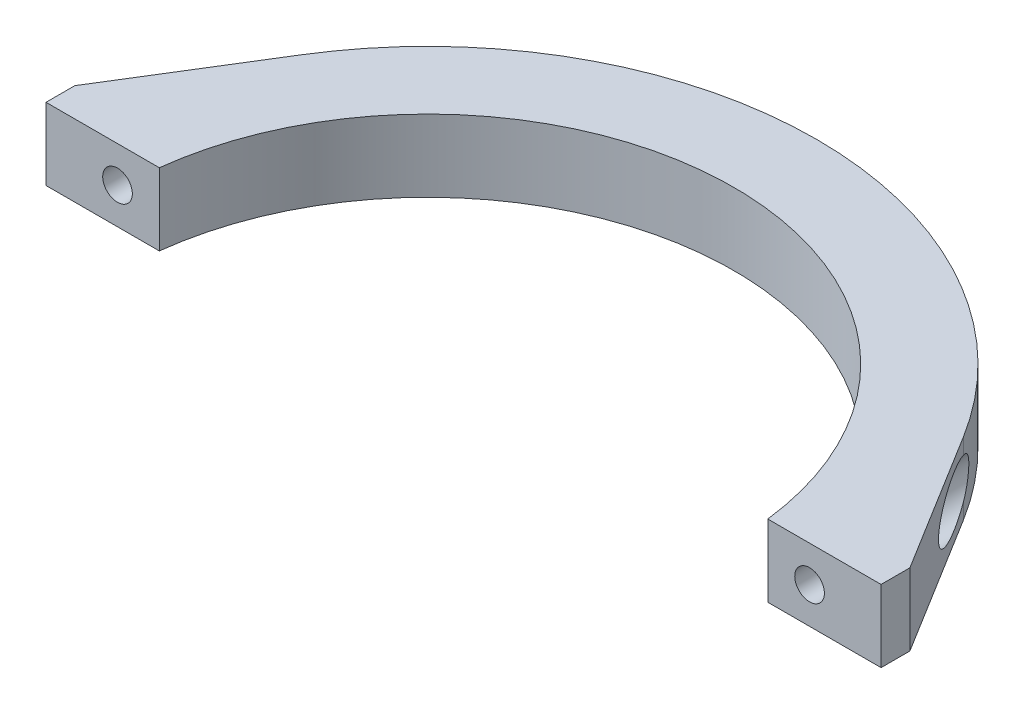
ISO-10303-21;
HEADER;
FILE_DESCRIPTION(('STEP AP214'),'2;1');
FILE_NAME('part.step','',(''),(''),'','','');
FILE_SCHEMA(('AUTOMOTIVE_DESIGN { 1 0 10303 214 1 1 1 1 }'));
ENDSEC;
DATA;
#1=APPLICATION_CONTEXT('core data for automotive mechanical design processes');
#2=APPLICATION_PROTOCOL_DEFINITION('international standard','automotive_design',2000,#1);
#3=PRODUCT_CONTEXT('',#1,'mechanical');
#4=PRODUCT('Part','Part','',(#3));
#5=PRODUCT_RELATED_PRODUCT_CATEGORY('part','',(#4));
#6=PRODUCT_DEFINITION_FORMATION('','',#4);
#7=PRODUCT_DEFINITION_CONTEXT('part definition',#1,'design');
#8=PRODUCT_DEFINITION('design','',#6,#7);
#9=PRODUCT_DEFINITION_SHAPE('','',#8);
#10=(LENGTH_UNIT() NAMED_UNIT(*) SI_UNIT(.MILLI.,.METRE.));
#11=(NAMED_UNIT(*) PLANE_ANGLE_UNIT() SI_UNIT($,.RADIAN.));
#12=(NAMED_UNIT(*) SI_UNIT($,.STERADIAN.) SOLID_ANGLE_UNIT());
#13=UNCERTAINTY_MEASURE_WITH_UNIT(LENGTH_MEASURE(1.E-05),#10,'distance_accuracy_value','');
#14=(GEOMETRIC_REPRESENTATION_CONTEXT(3) GLOBAL_UNCERTAINTY_ASSIGNED_CONTEXT((#13)) GLOBAL_UNIT_ASSIGNED_CONTEXT((#10,
#11,#12)) REPRESENTATION_CONTEXT('',''));
#15=CARTESIAN_POINT('',(0.,0.,0.));
#16=DIRECTION('',(0.,0.,1.));
#17=DIRECTION('',(1.,0.,0.));
#18=AXIS2_PLACEMENT_3D('',#15,#16,#17);
#19=CARTESIAN_POINT('',(91.948,30.9626,-158.75));
#20=DIRECTION('',(1.,0.,0.));
#21=DIRECTION('',(0.,0.,-1.));
#22=AXIS2_PLACEMENT_3D('',#19,#20,#21);
#23=PLANE('',#22);
#24=DIRECTION('',(0.,0.,-1.));
#25=VECTOR('',#24,1.);
#26=CARTESIAN_POINT('',(91.948,46.8376,-158.75));
#27=LINE('',#26,#25);
#28=CARTESIAN_POINT('',(91.948,46.8376,-158.75));
#29=VERTEX_POINT('',#28);
#30=CARTESIAN_POINT('',(91.948,46.8376,-165.1));
#31=VERTEX_POINT('',#30);
#32=EDGE_CURVE('E195',#29,#31,#27,.T.);
#33=ORIENTED_EDGE('',*,*,#32,.F.);
#34=DIRECTION('',(0.,1.,0.));
#35=VECTOR('',#34,1.);
#36=CARTESIAN_POINT('',(91.948,30.9626,-158.75));
#37=LINE('',#36,#35);
#38=CARTESIAN_POINT('',(91.948,30.9626,-158.75));
#39=VERTEX_POINT('',#38);
#40=EDGE_CURVE('E149',#39,#29,#37,.T.);
#41=ORIENTED_EDGE('',*,*,#40,.F.);
#42=DIRECTION('',(0.,0.,-1.));
#43=VECTOR('',#42,1.);
#44=CARTESIAN_POINT('',(91.948,30.9626,-158.75));
#45=LINE('',#44,#43);
#46=CARTESIAN_POINT('',(91.948,30.9626,-165.1));
#47=VERTEX_POINT('',#46);
#48=EDGE_CURVE('E210',#39,#47,#45,.T.);
#49=ORIENTED_EDGE('',*,*,#48,.T.);
#50=DIRECTION('',(0.,1.,0.));
#51=VECTOR('',#50,1.);
#52=CARTESIAN_POINT('',(91.948,30.9626,-165.1));
#53=LINE('',#52,#51);
#54=EDGE_CURVE('E140',#47,#31,#53,.T.);
#55=ORIENTED_EDGE('',*,*,#54,.T.);
#56=EDGE_LOOP('',(#33,#41,#49,#55));
#57=FACE_BOUND('',#56,.T.);
#58=ADVANCED_FACE('F42',(#57),#23,.T.);
#59=CARTESIAN_POINT('',(91.948,30.9626,-158.75));
#60=DIRECTION('',(0.,0.,1.));
#61=DIRECTION('',(1.,0.,0.));
#62=AXIS2_PLACEMENT_3D('',#59,#60,#61);
#63=PLANE('',#62);
#64=CARTESIAN_POINT('',(76.2,38.9001,-158.75));
#65=DIRECTION('',(0.,0.,-1.));
#66=DIRECTION('',(-1.,0.,0.));
#67=AXIS2_PLACEMENT_3D('',#64,#65,#66);
#68=CIRCLE('',#67,3.2639);
#69=CARTESIAN_POINT('',(72.9361,38.9001,-158.75));
#70=VERTEX_POINT('',#69);
#71=EDGE_CURVE('E294',#70,#70,#68,.T.);
#72=ORIENTED_EDGE('',*,*,#71,.T.);
#73=EDGE_LOOP('',(#72));
#74=FACE_BOUND('',#73,.T.);
#75=DIRECTION('',(1.,0.,0.));
#76=VECTOR('',#75,1.);
#77=CARTESIAN_POINT('',(91.948,46.8376,-158.75));
#78=LINE('',#77,#76);
#79=CARTESIAN_POINT('',(66.9938169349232,46.8376,-158.75));
#80=VERTEX_POINT('',#79);
#81=EDGE_CURVE('E205',#80,#29,#78,.T.);
#82=ORIENTED_EDGE('',*,*,#81,.F.);
#83=DIRECTION('',(0.,1.,0.));
#84=VECTOR('',#83,1.);
#85=CARTESIAN_POINT('',(66.9938169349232,30.9626,-158.75));
#86=LINE('',#85,#84);
#87=CARTESIAN_POINT('',(66.9938169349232,30.9626,-158.75));
#88=VERTEX_POINT('',#87);
#89=EDGE_CURVE('E219',#88,#80,#86,.T.);
#90=ORIENTED_EDGE('',*,*,#89,.F.);
#91=DIRECTION('',(1.,0.,0.));
#92=VECTOR('',#91,1.);
#93=CARTESIAN_POINT('',(91.948,30.9626,-158.75));
#94=LINE('',#93,#92);
#95=EDGE_CURVE('E143',#88,#39,#94,.T.);
#96=ORIENTED_EDGE('',*,*,#95,.T.);
#97=ORIENTED_EDGE('',*,*,#40,.T.);
#98=EDGE_LOOP('',(#82,#90,#96,#97));
#99=FACE_BOUND('',#98,.T.);
#100=ADVANCED_FACE('F167',(#74,#99),#63,.T.);
#101=CARTESIAN_POINT('',(0.,30.9626,-150.8125));
#102=DIRECTION('',(0.,1.,0.));
#103=DIRECTION('',(0.,0.,1.));
#104=AXIS2_PLACEMENT_3D('',#101,#102,#103);
#105=CYLINDRICAL_SURFACE('',#104,67.4624);
#106=CARTESIAN_POINT('',(0.,46.8376,-150.8125));
#107=DIRECTION('',(0.,-1.,0.));
#108=DIRECTION('',(0.,0.,1.));
#109=AXIS2_PLACEMENT_3D('',#106,#107,#108);
#110=CIRCLE('',#109,67.4624);
#111=CARTESIAN_POINT('',(-66.9938169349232,46.8376,-158.75));
#112=VERTEX_POINT('',#111);
#113=EDGE_CURVE('E208',#112,#80,#110,.T.);
#114=ORIENTED_EDGE('',*,*,#113,.F.);
#115=DIRECTION('',(0.,1.,0.));
#116=VECTOR('',#115,1.);
#117=CARTESIAN_POINT('',(-66.9938169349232,30.9626,-158.75));
#118=LINE('',#117,#116);
#119=CARTESIAN_POINT('',(-66.9938169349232,30.9626,-158.75));
#120=VERTEX_POINT('',#119);
#121=EDGE_CURVE('E221',#120,#112,#118,.T.);
#122=ORIENTED_EDGE('',*,*,#121,.F.);
#123=CARTESIAN_POINT('',(0.,30.9626,-150.8125));
#124=DIRECTION('',(0.,-1.,0.));
#125=DIRECTION('',(0.,0.,1.));
#126=AXIS2_PLACEMENT_3D('',#123,#124,#125);
#127=CIRCLE('',#126,67.4624);
#128=EDGE_CURVE('E246',#120,#88,#127,.T.);
#129=ORIENTED_EDGE('',*,*,#128,.T.);
#130=ORIENTED_EDGE('',*,*,#89,.T.);
#131=EDGE_LOOP('',(#114,#122,#129,#130));
#132=FACE_BOUND('',#131,.T.);
#133=ADVANCED_FACE('F170',(#132),#105,.F.);
#134=CARTESIAN_POINT('',(-91.948,30.9626,-158.75));
#135=DIRECTION('',(0.,0.,1.));
#136=DIRECTION('',(1.,0.,0.));
#137=AXIS2_PLACEMENT_3D('',#134,#135,#136);
#138=PLANE('',#137);
#139=CARTESIAN_POINT('',(-76.2,38.9001,-158.75));
#140=DIRECTION('',(0.,0.,-1.));
#141=DIRECTION('',(-1.,0.,0.));
#142=AXIS2_PLACEMENT_3D('',#139,#140,#141);
#143=CIRCLE('',#142,3.2639);
#144=CARTESIAN_POINT('',(-79.4639,38.9001,-158.75));
#145=VERTEX_POINT('',#144);
#146=EDGE_CURVE('E303',#145,#145,#143,.T.);
#147=ORIENTED_EDGE('',*,*,#146,.T.);
#148=EDGE_LOOP('',(#147));
#149=FACE_BOUND('',#148,.T.);
#150=DIRECTION('',(1.,0.,0.));
#151=VECTOR('',#150,1.);
#152=CARTESIAN_POINT('',(-91.948,46.8376,-158.75));
#153=LINE('',#152,#151);
#154=CARTESIAN_POINT('',(-91.948,46.8376,-158.75));
#155=VERTEX_POINT('',#154);
#156=EDGE_CURVE('E214',#155,#112,#153,.T.);
#157=ORIENTED_EDGE('',*,*,#156,.F.);
#158=DIRECTION('',(0.,1.,0.));
#159=VECTOR('',#158,1.);
#160=CARTESIAN_POINT('',(-91.948,30.9626,-158.75));
#161=LINE('',#160,#159);
#162=CARTESIAN_POINT('',(-91.948,30.9626,-158.75));
#163=VERTEX_POINT('',#162);
#164=EDGE_CURVE('E223',#163,#155,#161,.T.);
#165=ORIENTED_EDGE('',*,*,#164,.F.);
#166=DIRECTION('',(1.,0.,0.));
#167=VECTOR('',#166,1.);
#168=CARTESIAN_POINT('',(-91.948,30.9626,-158.75));
#169=LINE('',#168,#167);
#170=EDGE_CURVE('E238',#163,#120,#169,.T.);
#171=ORIENTED_EDGE('',*,*,#170,.T.);
#172=ORIENTED_EDGE('',*,*,#121,.T.);
#173=EDGE_LOOP('',(#157,#165,#171,#172));
#174=FACE_BOUND('',#173,.T.);
#175=ADVANCED_FACE('F174',(#149,#174),#138,.T.);
#176=CARTESIAN_POINT('',(-91.948,30.9626,-158.75));
#177=DIRECTION('',(-1.,0.,0.));
#178=DIRECTION('',(0.,0.,1.));
#179=AXIS2_PLACEMENT_3D('',#176,#177,#178);
#180=PLANE('',#179);
#181=DIRECTION('',(0.,0.,1.));
#182=VECTOR('',#181,1.);
#183=CARTESIAN_POINT('',(-91.948,46.8376,-158.75));
#184=LINE('',#183,#182);
#185=CARTESIAN_POINT('',(-91.948,46.8376,-165.1));
#186=VERTEX_POINT('',#185);
#187=EDGE_CURVE('E261',#186,#155,#184,.T.);
#188=ORIENTED_EDGE('',*,*,#187,.F.);
#189=DIRECTION('',(0.,1.,0.));
#190=VECTOR('',#189,1.);
#191=CARTESIAN_POINT('',(-91.948,30.9626,-165.1));
#192=LINE('',#191,#190);
#193=CARTESIAN_POINT('',(-91.948,30.9626,-165.1));
#194=VERTEX_POINT('',#193);
#195=EDGE_CURVE('E224',#194,#186,#192,.T.);
#196=ORIENTED_EDGE('',*,*,#195,.F.);
#197=DIRECTION('',(0.,0.,1.));
#198=VECTOR('',#197,1.);
#199=CARTESIAN_POINT('',(-91.948,30.9626,-158.75));
#200=LINE('',#199,#198);
#201=EDGE_CURVE('E236',#194,#163,#200,.T.);
#202=ORIENTED_EDGE('',*,*,#201,.T.);
#203=ORIENTED_EDGE('',*,*,#164,.T.);
#204=EDGE_LOOP('',(#188,#196,#202,#203));
#205=FACE_BOUND('',#204,.T.);
#206=ADVANCED_FACE('F178',(#205),#180,.T.);
#207=CARTESIAN_POINT('',(-91.948,30.9626,-165.1));
#208=DIRECTION('',(-0.850621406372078,0.,-0.525778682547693));
#209=DIRECTION('',(-0.525778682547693,0.,0.850621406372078));
#210=AXIS2_PLACEMENT_3D('',#207,#208,#209);
#211=PLANE('',#210);
#212=CARTESIAN_POINT('',(-76.2,38.9001,-190.577613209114));
#213=DIRECTION('',(-0.850621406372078,0.,-0.525778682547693));
#214=DIRECTION('',(-0.525778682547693,0.,0.850621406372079));
#215=AXIS2_PLACEMENT_3D('',#212,#213,#214);
#216=ELLIPSE('',#215,10.5676593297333,5.55625);
#217=CARTESIAN_POINT('',(-72.9195200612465,34.415641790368,-195.884877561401));
#218=VERTEX_POINT('',#217);
#219=CARTESIAN_POINT('',(-72.9195200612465,43.384558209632,-195.884877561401));
#220=VERTEX_POINT('',#219);
#221=EDGE_CURVE('E63',#218,#220,#216,.T.);
#222=ORIENTED_EDGE('',*,*,#221,.F.);
#223=DIRECTION('',(0.,1.,0.));
#224=VECTOR('',#223,1.);
#225=CARTESIAN_POINT('',(-72.9195200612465,30.9626,-195.884877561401));
#226=LINE('',#225,#224);
#227=CARTESIAN_POINT('',(-72.9195200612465,30.9626,-195.884877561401));
#228=VERTEX_POINT('',#227);
#229=EDGE_CURVE('E138',#228,#218,#226,.T.);
#230=ORIENTED_EDGE('',*,*,#229,.F.);
#231=DIRECTION('',(-0.525778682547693,0.,0.850621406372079));
#232=VECTOR('',#231,1.);
#233=CARTESIAN_POINT('',(-91.948,30.9626,-165.1));
#234=LINE('',#233,#232);
#235=EDGE_CURVE('E232',#228,#194,#234,.T.);
#236=ORIENTED_EDGE('',*,*,#235,.T.);
#237=ORIENTED_EDGE('',*,*,#195,.T.);
#238=DIRECTION('',(-0.525778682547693,0.,0.850621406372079));
#239=VECTOR('',#238,1.);
#240=CARTESIAN_POINT('',(-91.948,46.8376,-165.1));
#241=LINE('',#240,#239);
#242=CARTESIAN_POINT('',(-72.9195200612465,46.8376,-195.884877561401));
#243=VERTEX_POINT('',#242);
#244=EDGE_CURVE('E257',#243,#186,#241,.T.);
#245=ORIENTED_EDGE('',*,*,#244,.F.);
#246=EDGE_CURVE('E135',#220,#243,#226,.T.);
#247=ORIENTED_EDGE('',*,*,#246,.F.);
#248=EDGE_LOOP('',(#222,#230,#236,#237,#245,#247));
#249=FACE_BOUND('',#248,.T.);
#250=ADVANCED_FACE('F181',(#249),#211,.T.);
#251=CARTESIAN_POINT('',(0.,30.9626,-150.8125));
#252=DIRECTION('',(0.,1.,0.));
#253=DIRECTION('',(0.,0.,1.));
#254=AXIS2_PLACEMENT_3D('',#251,#252,#253);
#255=CYLINDRICAL_SURFACE('',#254,85.725);
#256=CARTESIAN_POINT('',(81.75625,38.9001,-176.594106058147));
#257=CARTESIAN_POINT('',(81.7562426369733,38.7890060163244,-176.594130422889));
#258=CARTESIAN_POINT('',(81.7528677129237,38.6777804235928,-176.604839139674));
#259=CARTESIAN_POINT('',(81.7398358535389,38.4594080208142,-176.646107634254));
#260=CARTESIAN_POINT('',(81.7301632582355,38.3522720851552,-176.676716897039));
#261=CARTESIAN_POINT('',(81.7024748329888,38.1177792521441,-176.764066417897));
#262=CARTESIAN_POINT('',(81.6829443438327,37.9923996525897,-176.825529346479));
#263=CARTESIAN_POINT('',(81.6379906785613,37.7533332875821,-176.966267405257));
#264=CARTESIAN_POINT('',(81.6125544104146,37.6396733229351,-177.045582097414));
#265=CARTESIAN_POINT('',(81.5598762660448,37.4324338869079,-177.208881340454));
#266=CARTESIAN_POINT('',(81.5329783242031,37.3379680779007,-177.291876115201));
#267=CARTESIAN_POINT('',(81.4765122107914,37.1567263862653,-177.465115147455));
#268=CARTESIAN_POINT('',(81.446941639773,37.0699575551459,-177.555365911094));
#269=CARTESIAN_POINT('',(81.3856494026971,36.9028803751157,-177.741319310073));
#270=CARTESIAN_POINT('',(81.3539228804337,36.822587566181,-177.837034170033));
#271=CARTESIAN_POINT('',(81.2887756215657,36.6677651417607,-178.032367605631));
#272=CARTESIAN_POINT('',(81.2553555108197,36.5932334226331,-178.131984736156));
#273=CARTESIAN_POINT('',(81.1688142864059,36.4105599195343,-178.388322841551));
#274=CARTESIAN_POINT('',(81.1147155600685,36.305760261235,-178.547091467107));
#275=CARTESIAN_POINT('',(81.0037339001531,36.1056183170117,-178.869582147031));
#276=CARTESIAN_POINT('',(80.9468495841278,36.0102807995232,-179.033306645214));
#277=CARTESIAN_POINT('',(80.8305979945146,35.8274420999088,-179.364573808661));
#278=CARTESIAN_POINT('',(80.7712268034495,35.7399540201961,-179.532122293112));
#279=CARTESIAN_POINT('',(80.6503305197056,35.5718594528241,-179.869891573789));
#280=CARTESIAN_POINT('',(80.5888050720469,35.4912541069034,-180.04011280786));
#281=CARTESIAN_POINT('',(80.4634433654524,35.3356931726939,-180.383490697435));
#282=CARTESIAN_POINT('',(80.3995964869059,35.2607701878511,-180.55665819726));
#283=CARTESIAN_POINT('',(80.2700240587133,35.1164228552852,-180.90458110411));
#284=CARTESIAN_POINT('',(80.2042983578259,35.0469989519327,-181.079336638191));
#285=CARTESIAN_POINT('',(80.0045763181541,34.8463629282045,-181.605092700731));
#286=CARTESIAN_POINT('',(79.8679026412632,34.722624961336,-181.957945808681));
#287=CARTESIAN_POINT('',(79.5873387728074,34.4920508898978,-182.668073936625));
#288=CARTESIAN_POINT('',(79.4434209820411,34.3852870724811,-183.025361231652));
#289=CARTESIAN_POINT('',(79.1491527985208,34.1877960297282,-183.74177598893));
#290=CARTESIAN_POINT('',(78.9988013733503,34.0970713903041,-184.10090373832));
#291=CARTESIAN_POINT('',(78.6917304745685,33.9308244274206,-184.820445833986));
#292=CARTESIAN_POINT('',(78.5350039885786,33.8553194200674,-185.180861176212));
#293=CARTESIAN_POINT('',(78.2155315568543,33.7193978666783,-185.901838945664));
#294=CARTESIAN_POINT('',(78.0527860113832,33.6589803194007,-186.262401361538));
#295=CARTESIAN_POINT('',(77.7223052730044,33.5536601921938,-186.981195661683));
#296=CARTESIAN_POINT('',(77.5546004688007,33.5086784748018,-187.339429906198));
#297=CARTESIAN_POINT('',(77.2135836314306,33.4342953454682,-188.054884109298));
#298=CARTESIAN_POINT('',(77.0402712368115,33.4048949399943,-188.41210400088));
#299=CARTESIAN_POINT('',(76.6884779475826,33.3625319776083,-189.124516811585));
#300=CARTESIAN_POINT('',(76.510002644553,33.3495522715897,-189.479711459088));
#301=CARTESIAN_POINT('',(76.1480594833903,33.3411445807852,-190.187703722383));
#302=CARTESIAN_POINT('',(75.9645925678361,33.3457133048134,-190.54050177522));
#303=CARTESIAN_POINT('',(75.6231725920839,33.3716691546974,-191.186034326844));
#304=CARTESIAN_POINT('',(75.4658996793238,33.3902126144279,-191.479242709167));
#305=CARTESIAN_POINT('',(75.1484962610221,33.4418847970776,-192.06282654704));
#306=CARTESIAN_POINT('',(74.9883658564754,33.4750130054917,-192.353202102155));
#307=CARTESIAN_POINT('',(74.6652742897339,33.5574033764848,-192.93116970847));
#308=CARTESIAN_POINT('',(74.5023065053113,33.6067100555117,-193.218751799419));
#309=CARTESIAN_POINT('',(74.1746535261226,33.7232163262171,-193.789291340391));
#310=CARTESIAN_POINT('',(74.0099684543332,33.7904146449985,-194.072249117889));
#311=CARTESIAN_POINT('',(73.6776585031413,33.9459291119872,-194.635856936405));
#312=CARTESIAN_POINT('',(73.5100232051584,34.0345079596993,-194.916429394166));
#313=CARTESIAN_POINT('',(73.1752683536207,34.2352270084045,-195.469641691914));
#314=CARTESIAN_POINT('',(73.0081491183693,34.3473795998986,-195.742277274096));
#315=CARTESIAN_POINT('',(72.6774511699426,34.5981892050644,-196.275246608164));
#316=CARTESIAN_POINT('',(72.5138581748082,34.7366992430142,-196.535639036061));
#317=CARTESIAN_POINT('',(72.273047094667,34.9677641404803,-196.914612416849));
#318=CARTESIAN_POINT('',(72.1935812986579,35.0486193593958,-197.038937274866));
#319=CARTESIAN_POINT('',(72.0367090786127,35.2187524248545,-197.283019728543));
#320=CARTESIAN_POINT('',(71.9593023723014,35.3080291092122,-197.402777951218));
#321=CARTESIAN_POINT('',(71.7669814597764,35.5453442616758,-197.698760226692));
#322=CARTESIAN_POINT('',(71.6538730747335,35.6994959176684,-197.871364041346));
#323=CARTESIAN_POINT('',(71.4373315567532,36.0316032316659,-198.199438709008));
#324=CARTESIAN_POINT('',(71.3339063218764,36.2095780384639,-198.354895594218));
#325=CARTESIAN_POINT('',(71.1404730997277,36.5936514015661,-198.643862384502));
#326=CARTESIAN_POINT('',(71.0506350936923,36.8000528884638,-198.777096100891));
#327=CARTESIAN_POINT('',(70.9324056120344,37.1286876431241,-198.951615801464));
#328=CARTESIAN_POINT('',(70.8957676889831,37.2413301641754,-199.005542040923));
#329=CARTESIAN_POINT('',(70.8289218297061,37.4725447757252,-199.103730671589));
#330=CARTESIAN_POINT('',(70.7987107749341,37.5911139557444,-199.147997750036));
#331=CARTESIAN_POINT('',(70.7347525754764,37.8834467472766,-199.241570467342));
#332=CARTESIAN_POINT('',(70.7046729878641,38.0598314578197,-199.285443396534));
#333=CARTESIAN_POINT('',(70.6616711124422,38.4189701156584,-199.348109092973));
#334=CARTESIAN_POINT('',(70.648735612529,38.60171904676,-199.366921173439));
#335=CARTESIAN_POINT('',(70.641138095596,38.9688070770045,-199.377974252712));
#336=CARTESIAN_POINT('',(70.6465137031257,39.1531486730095,-199.370160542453));
#337=CARTESIAN_POINT('',(70.6751256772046,39.5174433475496,-199.328506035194));
#338=CARTESIAN_POINT('',(70.6983696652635,39.6973945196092,-199.294654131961));
#339=CARTESIAN_POINT('',(70.7602140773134,40.0452457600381,-199.204344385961));
#340=CARTESIAN_POINT('',(70.7985449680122,40.2132993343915,-199.148283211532));
#341=CARTESIAN_POINT('',(70.8879777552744,40.5380124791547,-199.017028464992));
#342=CARTESIAN_POINT('',(70.9390844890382,40.6946677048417,-198.941827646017));
#343=CARTESIAN_POINT('',(71.0847077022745,41.0843456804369,-198.726642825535));
#344=CARTESIAN_POINT('',(71.1870396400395,41.3078548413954,-198.574622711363));
#345=CARTESIAN_POINT('',(71.3531308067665,41.619239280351,-198.325829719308));
#346=CARTESIAN_POINT('',(71.4107083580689,41.7192123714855,-198.239263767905));
#347=CARTESIAN_POINT('',(71.5292818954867,41.9115855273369,-198.060240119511));
#348=CARTESIAN_POINT('',(71.5902772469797,42.0039869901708,-197.967783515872));
#349=CARTESIAN_POINT('',(71.7536371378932,42.2366737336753,-197.719055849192));
#350=CARTESIAN_POINT('',(71.8581991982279,42.3711185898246,-197.558767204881));
#351=CARTESIAN_POINT('',(72.0721151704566,42.622973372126,-197.228280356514));
#352=CARTESIAN_POINT('',(72.1814721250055,42.7403722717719,-197.058075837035));
#353=CARTESIAN_POINT('',(72.4034050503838,42.9599233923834,-196.709833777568));
#354=CARTESIAN_POINT('',(72.5159844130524,43.06205878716,-196.531787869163));
#355=CARTESIAN_POINT('',(72.7430785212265,43.25252164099,-196.169592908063));
#356=CARTESIAN_POINT('',(72.8575939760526,43.3408439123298,-195.985441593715));
#357=CARTESIAN_POINT('',(73.0770412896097,43.4974358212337,-195.629475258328));
#358=CARTESIAN_POINT('',(73.1818850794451,43.5668029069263,-195.4580848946));
#359=CARTESIAN_POINT('',(73.3919143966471,43.6961157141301,-195.111975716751));
#360=CARTESIAN_POINT('',(73.4970999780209,43.7560598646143,-194.937256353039));
#361=CARTESIAN_POINT('',(73.8126699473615,43.9229809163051,-194.40875638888));
#362=CARTESIAN_POINT('',(74.0229737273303,44.016981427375,-194.050785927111));
#363=CARTESIAN_POINT('',(74.4415063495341,44.1754916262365,-193.326185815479));
#364=CARTESIAN_POINT('',(74.6497288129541,44.2399281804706,-192.959537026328));
#365=CARTESIAN_POINT('',(75.0622803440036,44.3427743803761,-192.220336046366));
#366=CARTESIAN_POINT('',(75.2666081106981,44.3811754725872,-191.847781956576));
#367=CARTESIAN_POINT('',(75.6452771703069,44.4314637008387,-191.144952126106));
#368=CARTESIAN_POINT('',(75.820192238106,44.4460504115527,-190.815169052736));
#369=CARTESIAN_POINT('',(76.1658265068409,44.4589357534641,-190.153089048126));
#370=CARTESIAN_POINT('',(76.3365455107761,44.4572336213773,-189.820791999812));
#371=CARTESIAN_POINT('',(76.6735855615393,44.4387041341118,-189.154077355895));
#372=CARTESIAN_POINT('',(76.8399029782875,44.4218646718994,-188.819658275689));
#373=CARTESIAN_POINT('',(77.1677605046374,44.3739287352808,-188.149499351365));
#374=CARTESIAN_POINT('',(77.3293004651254,44.3428318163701,-187.813759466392));
#375=CARTESIAN_POINT('',(77.6471167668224,44.2670735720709,-187.142083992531));
#376=CARTESIAN_POINT('',(77.8034021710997,44.222437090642,-186.806149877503));
#377=CARTESIAN_POINT('',(78.1108652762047,44.1199439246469,-186.133951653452));
#378=CARTESIAN_POINT('',(78.2620428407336,44.0620868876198,-185.797687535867));
#379=CARTESIAN_POINT('',(78.5590336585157,43.9332952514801,-185.12559863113));
#380=CARTESIAN_POINT('',(78.7048507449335,43.8623702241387,-184.78977370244));
#381=CARTESIAN_POINT('',(78.9910768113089,43.7072109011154,-184.11893110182));
#382=CARTESIAN_POINT('',(79.1314864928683,43.6229783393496,-183.783913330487));
#383=CARTESIAN_POINT('',(79.3553122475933,43.4746599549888,-183.240286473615));
#384=CARTESIAN_POINT('',(79.4404228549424,43.4148045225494,-183.031212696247));
#385=CARTESIAN_POINT('',(79.6084008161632,43.28937211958,-182.613894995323));
#386=CARTESIAN_POINT('',(79.6912683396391,43.223795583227,-182.405651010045));
#387=CARTESIAN_POINT('',(79.8547286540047,43.0865385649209,-181.990180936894));
#388=CARTESIAN_POINT('',(79.9353205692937,43.0148557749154,-181.782955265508));
#389=CARTESIAN_POINT('',(80.0941070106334,42.8649166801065,-181.369963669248));
#390=CARTESIAN_POINT('',(80.1723015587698,42.7866604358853,-181.16419773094));
#391=CARTESIAN_POINT('',(80.3276208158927,42.6213591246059,-180.750746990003));
#392=CARTESIAN_POINT('',(80.4046976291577,42.5341762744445,-180.5430990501));
#393=CARTESIAN_POINT('',(80.5560438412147,42.3513156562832,-180.130543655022));
#394=CARTESIAN_POINT('',(80.6303135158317,42.2556387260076,-179.925635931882));
#395=CARTESIAN_POINT('',(80.7756367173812,42.0545932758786,-179.51996359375));
#396=CARTESIAN_POINT('',(80.8466960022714,41.9492432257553,-179.319191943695));
#397=CARTESIAN_POINT('',(80.9852822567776,41.7267922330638,-178.923060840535));
#398=CARTESIAN_POINT('',(81.0528109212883,41.6096970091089,-178.727698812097));
#399=CARTESIAN_POINT('',(81.1735853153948,41.3799213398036,-178.374321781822));
#400=CARTESIAN_POINT('',(81.2274337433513,41.2693154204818,-178.21517228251));
#401=CARTESIAN_POINT('',(81.3314439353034,41.0347563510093,-177.904908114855));
#402=CARTESIAN_POINT('',(81.3815970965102,40.910773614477,-177.75381240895));
#403=CARTESIAN_POINT('',(81.4531517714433,40.7115432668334,-177.536377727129));
#404=CARTESIAN_POINT('',(81.4765155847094,40.6424832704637,-177.465047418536));
#405=CARTESIAN_POINT('',(81.5215912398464,40.4995407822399,-177.326856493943));
#406=CARTESIAN_POINT('',(81.5433024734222,40.4256565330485,-177.25999752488));
#407=CARTESIAN_POINT('',(81.6052596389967,40.1962988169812,-177.068449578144));
#408=CARTESIAN_POINT('',(81.6425856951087,40.0324396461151,-176.952007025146));
#409=CARTESIAN_POINT('',(81.6897821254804,39.7622469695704,-176.804002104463));
#410=CARTESIAN_POINT('',(81.7043484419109,39.6645960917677,-176.758148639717));
#411=CARTESIAN_POINT('',(81.7285908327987,39.4629725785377,-176.681683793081));
#412=CARTESIAN_POINT('',(81.7382803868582,39.3590182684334,-176.651030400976));
#413=CARTESIAN_POINT('',(81.7487201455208,39.195077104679,-176.617974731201));
#414=CARTESIAN_POINT('',(81.7515314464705,39.1364914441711,-176.60906518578));
#415=CARTESIAN_POINT('',(81.7552985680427,39.0186497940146,-176.597123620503));
#416=CARTESIAN_POINT('',(81.7562539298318,38.9593936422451,-176.594093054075));
#417=CARTESIAN_POINT('',(81.75625,38.9001,-176.594106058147));
#418=B_SPLINE_CURVE_WITH_KNOTS('',3,(#256,#257,#258,#259,#260,#261,#262,#263,#264,#265,#266,
#267,#268,#269,#270,#271,#272,#273,#274,#275,#276,#277,#278,#279,#280,#281,#282,#283,#284,#285,
#286,#287,#288,#289,#290,#291,#292,#293,#294,#295,#296,#297,#298,#299,#300,#301,#302,#303,#304,
#305,#306,#307,#308,#309,#310,#311,#312,#313,#314,#315,#316,#317,#318,#319,#320,#321,#322,#323,
#324,#325,#326,#327,#328,#329,#330,#331,#332,#333,#334,#335,#336,#337,#338,#339,#340,#341,#342,
#343,#344,#345,#346,#347,#348,#349,#350,#351,#352,#353,#354,#355,#356,#357,#358,#359,#360,#361,
#362,#363,#364,#365,#366,#367,#368,#369,#370,#371,#372,#373,#374,#375,#376,#377,#378,#379,#380,
#381,#382,#383,#384,#385,#386,#387,#388,#389,#390,#391,#392,#393,#394,#395,#396,#397,#398,#399,
#400,#401,#402,#403,#404,#405,#406,#407,#408,#409,#410,#411,#412,#413,#414,#415,#416,#417),
.UNSPECIFIED.,.T.,.F.,(4,2,2,2,2,2,2,2,2,2,2,2,2,2,2,2,2,2,2,2,2,2,2,2,2,2,2,2,2,2,2,2,2,2,2,2,
2,2,2,2,2,2,2,2,2,2,2,2,2,2,2,2,2,2,2,2,2,2,2,2,2,2,2,2,2,2,2,2,2,2,2,2,2,2,2,2,2,2,2,2,4),(0.,
0.332995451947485,0.666822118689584,1.08737179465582,1.50886280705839,1.89406977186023,
2.27962607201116,2.66608161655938,3.05239537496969,3.64530884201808,4.23851960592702,
4.8327028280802,5.42698442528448,6.02445182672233,6.62196745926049,7.81574383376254,
9.01447526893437,10.2133997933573,11.4136807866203,12.6138821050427,13.8078348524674,
15.0018647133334,16.1946465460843,17.3872046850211,18.3866216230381,19.3860033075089,
20.3881582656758,21.390241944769,22.4053281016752,23.4209491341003,24.4310645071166,
24.9355799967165,25.4400259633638,26.211161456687,26.9829205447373,27.7636527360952,
28.1535435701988,28.5432447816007,29.0934350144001,29.6432009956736,30.1940972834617,
30.745228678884,31.2869309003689,31.8288385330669,32.690665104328,33.1231367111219,
33.555528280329,34.2560627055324,34.9570482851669,35.6588010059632,36.3608166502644,
36.9982162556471,37.6357220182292,38.9113018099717,40.190020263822,41.469158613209,
42.5895106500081,43.7099151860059,44.8312166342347,45.9525530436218,47.0718442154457,
48.1911652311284,49.3096696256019,50.4280284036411,51.1285608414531,51.8290401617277,
52.5297854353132,53.2305242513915,53.9444623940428,54.6583302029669,55.3708622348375,
56.0830490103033,56.6860695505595,57.290452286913,57.5962165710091,57.9020928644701,
58.5106621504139,58.8362363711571,59.1609056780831,59.3385897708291,59.5163177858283),.UNSPECIFIED.);
#419=CARTESIAN_POINT('',(72.9195200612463,34.4156417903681,-195.884877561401));
#420=VERTEX_POINT('',#419);
#421=CARTESIAN_POINT('',(72.9195200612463,43.3845582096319,-195.884877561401));
#422=VERTEX_POINT('',#421);
#423=EDGE_CURVE('E54',#420,#422,#418,.T.);
#424=ORIENTED_EDGE('',*,*,#423,.F.);
#425=DIRECTION('',(0.,1.,0.));
#426=VECTOR('',#425,1.);
#427=CARTESIAN_POINT('',(72.9195200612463,30.9626,-195.884877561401));
#428=LINE('',#427,#426);
#429=CARTESIAN_POINT('',(72.9195200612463,30.9626,-195.884877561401));
#430=VERTEX_POINT('',#429);
#431=EDGE_CURVE('E124',#430,#420,#428,.T.);
#432=ORIENTED_EDGE('',*,*,#431,.F.);
#433=CARTESIAN_POINT('',(0.,30.9626,-150.8125));
#434=DIRECTION('',(0.,1.,0.));
#435=DIRECTION('',(0.,0.,1.));
#436=AXIS2_PLACEMENT_3D('',#433,#434,#435);
#437=CIRCLE('',#436,85.725);
#438=EDGE_CURVE('E230',#430,#228,#437,.T.);
#439=ORIENTED_EDGE('',*,*,#438,.T.);
#440=ORIENTED_EDGE('',*,*,#229,.T.);
#441=CARTESIAN_POINT('',(-70.64375,38.9001,-199.374174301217));
#442=CARTESIAN_POINT('',(-70.6437461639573,38.7910739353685,-199.374179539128));
#443=CARTESIAN_POINT('',(-70.6469658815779,38.6820808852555,-199.369496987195));
#444=CARTESIAN_POINT('',(-70.6597310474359,38.4652154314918,-199.350919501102));
#445=CARTESIAN_POINT('',(-70.6692783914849,38.3573433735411,-199.337021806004));
#446=CARTESIAN_POINT('',(-70.6944230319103,38.1437146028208,-199.300381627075));
#447=CARTESIAN_POINT('',(-70.7100271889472,38.0379604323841,-199.277629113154));
#448=CARTESIAN_POINT('',(-70.7468317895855,37.8295417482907,-199.223887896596));
#449=CARTESIAN_POINT('',(-70.7680353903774,37.7268790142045,-199.192894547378));
#450=CARTESIAN_POINT('',(-70.838709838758,37.4269225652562,-199.089406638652));
#451=CARTESIAN_POINT('',(-70.895572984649,37.2350509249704,-199.005928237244));
#452=CARTESIAN_POINT('',(-71.0245371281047,36.869264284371,-198.815666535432));
#453=CARTESIAN_POINT('',(-71.0966443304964,36.6953566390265,-198.708873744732));
#454=CARTESIAN_POINT('',(-71.2951309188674,36.2743906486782,-198.413196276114));
#455=CARTESIAN_POINT('',(-71.4294814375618,36.0400173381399,-198.21155934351));
#456=CARTESIAN_POINT('',(-71.6429163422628,35.7186685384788,-197.887814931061));
#457=CARTESIAN_POINT('',(-71.7161846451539,35.6164354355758,-197.776138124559));
#458=CARTESIAN_POINT('',(-71.865823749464,35.4213182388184,-197.546830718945));
#459=CARTESIAN_POINT('',(-71.9421939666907,35.3284323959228,-197.4292012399));
#460=CARTESIAN_POINT('',(-72.1515911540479,35.089266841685,-197.104859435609));
#461=CARTESIAN_POINT('',(-72.286805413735,34.9512032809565,-196.893504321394));
#462=CARTESIAN_POINT('',(-72.5611330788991,34.6970630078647,-196.460320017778));
#463=CARTESIAN_POINT('',(-72.7002492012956,34.5810020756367,-196.238483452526));
#464=CARTESIAN_POINT('',(-72.9805711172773,34.3681934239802,-195.786743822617));
#465=CARTESIAN_POINT('',(-73.1217787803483,34.2714642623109,-195.556833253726));
#466=CARTESIAN_POINT('',(-73.4048820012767,34.0952028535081,-195.09086149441));
#467=CARTESIAN_POINT('',(-73.546777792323,34.0156769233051,-194.854798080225));
#468=CARTESIAN_POINT('',(-73.8191556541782,33.8776574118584,-194.396594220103));
#469=CARTESIAN_POINT('',(-73.9496605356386,33.8180038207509,-194.174812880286));
#470=CARTESIAN_POINT('',(-74.2098595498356,33.7105854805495,-193.727989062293));
#471=CARTESIAN_POINT('',(-74.3395538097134,33.6628188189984,-193.502947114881));
#472=CARTESIAN_POINT('',(-74.5978490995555,33.578116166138,-193.049978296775));
#473=CARTESIAN_POINT('',(-74.7264491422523,33.5411891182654,-192.822049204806));
#474=CARTESIAN_POINT('',(-74.9821413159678,33.4773611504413,-192.36394913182));
#475=CARTESIAN_POINT('',(-75.1092333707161,33.4504607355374,-192.13377803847));
#476=CARTESIAN_POINT('',(-75.3621296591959,33.4058818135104,-191.67072919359));
#477=CARTESIAN_POINT('',(-75.4879273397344,33.3882379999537,-191.437844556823));
#478=CARTESIAN_POINT('',(-75.7375503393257,33.3617061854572,-190.970553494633));
#479=CARTESIAN_POINT('',(-75.861375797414,33.3528175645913,-190.736147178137));
#480=CARTESIAN_POINT('',(-76.1068590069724,33.3432735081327,-190.266167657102));
#481=CARTESIAN_POINT('',(-76.228517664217,33.3426145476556,-190.03059499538));
#482=CARTESIAN_POINT('',(-76.469623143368,33.3490856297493,-189.558372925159));
#483=CARTESIAN_POINT('',(-76.5890694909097,33.3562173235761,-189.321723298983));
#484=CARTESIAN_POINT('',(-76.886716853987,33.3835073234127,-188.725159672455));
#485=CARTESIAN_POINT('',(-77.0634043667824,33.4084909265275,-188.364702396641));
#486=CARTESIAN_POINT('',(-77.4111589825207,33.4745737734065,-187.642498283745));
#487=CARTESIAN_POINT('',(-77.5822250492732,33.515675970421,-187.28075122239));
#488=CARTESIAN_POINT('',(-77.9185292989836,33.6133957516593,-186.556560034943));
#489=CARTESIAN_POINT('',(-78.0837663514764,33.6700163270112,-186.194115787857));
#490=CARTESIAN_POINT('',(-78.4081701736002,33.7984988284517,-185.469275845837));
#491=CARTESIAN_POINT('',(-78.5673377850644,33.8703586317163,-185.106880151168));
#492=CARTESIAN_POINT('',(-78.8790199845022,34.0292388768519,-184.383773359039));
#493=CARTESIAN_POINT('',(-79.0315516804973,34.116217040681,-184.023060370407));
#494=CARTESIAN_POINT('',(-79.3301935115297,34.3060700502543,-183.303234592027));
#495=CARTESIAN_POINT('',(-79.4763047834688,34.4089420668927,-182.944121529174));
#496=CARTESIAN_POINT('',(-79.7616633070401,34.6317003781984,-182.229065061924));
#497=CARTESIAN_POINT('',(-79.9009204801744,34.7515610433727,-181.873117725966));
#498=CARTESIAN_POINT('',(-80.1044762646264,34.9458943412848,-181.342557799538));
#499=CARTESIAN_POINT('',(-80.1714335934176,35.0130885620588,-181.166281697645));
#500=CARTESIAN_POINT('',(-80.3034993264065,35.1527735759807,-180.81514633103));
#501=CARTESIAN_POINT('',(-80.3686078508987,35.2252640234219,-180.640286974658));
#502=CARTESIAN_POINT('',(-80.5012694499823,35.3812664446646,-180.280456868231));
#503=CARTESIAN_POINT('',(-80.5686843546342,35.4651932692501,-180.095614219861));
#504=CARTESIAN_POINT('',(-80.7011148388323,35.6406569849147,-179.728650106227));
#505=CARTESIAN_POINT('',(-80.7661300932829,35.7321949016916,-179.546529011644));
#506=CARTESIAN_POINT('',(-80.8933522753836,35.9239313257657,-179.186388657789));
#507=CARTESIAN_POINT('',(-80.9555647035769,36.0241116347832,-179.008361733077));
#508=CARTESIAN_POINT('',(-81.0768722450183,36.234986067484,-178.65762216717));
#509=CARTESIAN_POINT('',(-81.1359687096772,36.3456755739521,-178.484907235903));
#510=CARTESIAN_POINT('',(-81.2505192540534,36.5803358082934,-178.146738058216));
#511=CARTESIAN_POINT('',(-81.3059661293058,36.7043316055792,-177.981298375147));
#512=CARTESIAN_POINT('',(-81.3853611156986,36.9028531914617,-177.742144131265));
#513=CARTESIAN_POINT('',(-81.4112079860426,36.9711495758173,-177.663892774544));
#514=CARTESIAN_POINT('',(-81.4613726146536,37.1125047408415,-177.511317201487));
#515=CARTESIAN_POINT('',(-81.4856907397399,37.185562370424,-177.436992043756));
#516=CARTESIAN_POINT('',(-81.5439665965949,37.37432978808,-177.258099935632));
#517=CARTESIAN_POINT('',(-81.5767952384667,37.4933700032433,-177.156601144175));
#518=CARTESIAN_POINT('',(-81.6365314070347,37.7456538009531,-176.97089884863));
#519=CARTESIAN_POINT('',(-81.6634541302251,37.8788595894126,-176.886650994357));
#520=CARTESIAN_POINT('',(-81.7009955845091,38.1127944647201,-176.768721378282));
#521=CARTESIAN_POINT('',(-81.7140502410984,38.2093113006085,-176.727569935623));
#522=CARTESIAN_POINT('',(-81.7353131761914,38.4080005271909,-176.66042938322));
#523=CARTESIAN_POINT('',(-81.7435284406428,38.5101645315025,-176.634418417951));
#524=CARTESIAN_POINT('',(-81.7542763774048,38.7187345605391,-176.600370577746));
#525=CARTESIAN_POINT('',(-81.7567604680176,38.8251691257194,-176.592487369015));
#526=CARTESIAN_POINT('',(-81.7555629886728,39.0376698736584,-176.596284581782));
#527=CARTESIAN_POINT('',(-81.7518801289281,39.1437359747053,-176.607969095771));
#528=CARTESIAN_POINT('',(-81.73952353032,39.3409559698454,-176.647094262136));
#529=CARTESIAN_POINT('',(-81.7314097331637,39.4325122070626,-176.672766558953));
#530=CARTESIAN_POINT('',(-81.7113345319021,39.6108512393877,-176.736129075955));
#531=CARTESIAN_POINT('',(-81.6993716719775,39.6976322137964,-176.773823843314));
#532=CARTESIAN_POINT('',(-81.6622832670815,39.9284465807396,-176.890326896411));
#533=CARTESIAN_POINT('',(-81.6339874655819,40.0670253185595,-176.978855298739));
#534=CARTESIAN_POINT('',(-81.5710795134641,40.3289760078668,-177.174314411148));
#535=CARTESIAN_POINT('',(-81.5364440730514,40.4522889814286,-177.281312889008));
#536=CARTESIAN_POINT('',(-81.4537207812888,40.714954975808,-177.534941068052));
#537=CARTESIAN_POINT('',(-81.4044244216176,40.8507324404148,-177.684827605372));
#538=CARTESIAN_POINT('',(-81.3010884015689,41.1068780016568,-177.995871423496));
#539=CARTESIAN_POINT('',(-81.2470401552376,41.2272171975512,-178.157048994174));
#540=CARTESIAN_POINT('',(-81.1350950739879,41.4560794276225,-178.487444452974));
#541=CARTESIAN_POINT('',(-81.0771811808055,41.5645436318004,-178.656696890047));
#542=CARTESIAN_POINT('',(-80.958435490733,41.7712274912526,-179.000092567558));
#543=CARTESIAN_POINT('',(-80.8976059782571,41.8694549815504,-179.174231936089));
#544=CARTESIAN_POINT('',(-80.7459937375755,42.0988906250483,-179.603684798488));
#545=CARTESIAN_POINT('',(-80.6538293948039,42.2255453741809,-179.860936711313));
#546=CARTESIAN_POINT('',(-80.4648646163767,42.4646496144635,-180.38034891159));
#547=CARTESIAN_POINT('',(-80.3680622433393,42.5770930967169,-180.642511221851));
#548=CARTESIAN_POINT('',(-80.1700976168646,42.7900091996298,-181.170541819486));
#549=CARTESIAN_POINT('',(-80.0689287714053,42.8904627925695,-181.436415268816));
#550=CARTESIAN_POINT('',(-79.8626253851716,43.0806213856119,-181.970463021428));
#551=CARTESIAN_POINT('',(-79.757490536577,43.1703255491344,-182.238637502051));
#552=CARTESIAN_POINT('',(-79.5432392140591,43.3400745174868,-182.777055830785));
#553=CARTESIAN_POINT('',(-79.4341158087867,43.4201013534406,-183.047302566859));
#554=CARTESIAN_POINT('',(-79.2121913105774,43.5709257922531,-183.588863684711));
#555=CARTESIAN_POINT('',(-79.0993900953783,43.6417230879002,-183.860178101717));
#556=CARTESIAN_POINT('',(-78.8703170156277,43.7744021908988,-184.40320524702));
#557=CARTESIAN_POINT('',(-78.7540484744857,43.8362922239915,-184.674917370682));
#558=CARTESIAN_POINT('',(-78.5180161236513,43.951432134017,-185.218671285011));
#559=CARTESIAN_POINT('',(-78.3982521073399,44.0046814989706,-185.490713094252));
#560=CARTESIAN_POINT('',(-78.1469570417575,44.105949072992,-186.053528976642));
#561=CARTESIAN_POINT('',(-78.0151831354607,44.1533558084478,-186.34430485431));
#562=CARTESIAN_POINT('',(-77.7478193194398,44.2382497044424,-186.925580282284));
#563=CARTESIAN_POINT('',(-77.6122290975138,44.2757360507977,-187.216079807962));
#564=CARTESIAN_POINT('',(-77.3372721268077,44.3405491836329,-187.796620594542));
#565=CARTESIAN_POINT('',(-77.1979033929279,44.3678705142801,-188.08666152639));
#566=CARTESIAN_POINT('',(-76.9155943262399,44.4119279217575,-188.665779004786));
#567=CARTESIAN_POINT('',(-76.7726543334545,44.4286650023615,-188.954855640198));
#568=CARTESIAN_POINT('',(-76.4841202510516,44.4509571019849,-189.530170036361));
#569=CARTESIAN_POINT('',(-76.3385446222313,44.4565719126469,-189.816414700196));
#570=CARTESIAN_POINT('',(-76.0441992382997,44.4561146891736,-190.387220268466));
#571=CARTESIAN_POINT('',(-75.8954298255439,44.4500439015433,-190.671781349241));
#572=CARTESIAN_POINT('',(-75.5950293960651,44.4253713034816,-191.238605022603));
#573=CARTESIAN_POINT('',(-75.4434003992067,44.4067780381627,-191.520869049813));
#574=CARTESIAN_POINT('',(-75.1375238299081,44.356022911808,-192.082712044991));
#575=CARTESIAN_POINT('',(-74.983276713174,44.3238633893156,-192.362291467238));
#576=CARTESIAN_POINT('',(-74.7131033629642,44.2550123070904,-192.845620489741));
#577=CARTESIAN_POINT('',(-74.5976744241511,44.2216900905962,-193.050130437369));
#578=CARTESIAN_POINT('',(-74.3658503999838,44.1463050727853,-193.456968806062));
#579=CARTESIAN_POINT('',(-74.2494554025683,44.1042430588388,-193.659297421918));
#580=CARTESIAN_POINT('',(-74.0155518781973,44.0104851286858,-194.062102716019));
#581=CARTESIAN_POINT('',(-73.8980408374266,43.958754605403,-194.262569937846));
#582=CARTESIAN_POINT('',(-73.662712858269,43.8449123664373,-194.660347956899));
#583=CARTESIAN_POINT('',(-73.5448959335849,43.7828011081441,-194.857658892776));
#584=CARTESIAN_POINT('',(-73.2745943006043,43.6271437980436,-195.30628339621));
#585=CARTESIAN_POINT('',(-73.1221615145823,43.5297336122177,-195.556310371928));
#586=CARTESIAN_POINT('',(-72.8189329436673,43.3131537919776,-196.048128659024));
#587=CARTESIAN_POINT('',(-72.66813817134,43.1939714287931,-196.289915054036));
#588=CARTESIAN_POINT('',(-72.3712054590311,42.9313949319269,-196.760963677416));
#589=CARTESIAN_POINT('',(-72.2250471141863,42.7881321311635,-196.990285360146));
#590=CARTESIAN_POINT('',(-71.9399114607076,42.4734182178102,-197.433244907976));
#591=CARTESIAN_POINT('',(-71.8009228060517,42.30201355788,-197.646907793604));
#592=CARTESIAN_POINT('',(-71.5634044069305,41.9670928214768,-198.008804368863));
#593=CARTESIAN_POINT('',(-71.4625951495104,41.8097847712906,-198.161236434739));
#594=CARTESIAN_POINT('',(-71.2716897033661,41.4732618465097,-198.448111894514));
#595=CARTESIAN_POINT('',(-71.1815997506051,41.2940343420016,-198.582544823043));
#596=CARTESIAN_POINT('',(-71.0159109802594,40.910353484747,-198.828521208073));
#597=CARTESIAN_POINT('',(-70.9404954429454,40.7056277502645,-198.939776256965));
#598=CARTESIAN_POINT('',(-70.8440810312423,40.3828887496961,-199.081487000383));
#599=CARTESIAN_POINT('',(-70.8147422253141,40.2727821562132,-199.124507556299));
#600=CARTESIAN_POINT('',(-70.7623795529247,40.0479263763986,-199.201170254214));
#601=CARTESIAN_POINT('',(-70.7393524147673,39.9331796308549,-199.234817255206));
#602=CARTESIAN_POINT('',(-70.6950156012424,39.6680205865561,-199.299532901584));
#603=CARTESIAN_POINT('',(-70.6758949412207,39.5164310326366,-199.32738417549));
#604=CARTESIAN_POINT('',(-70.6502652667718,39.2099053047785,-199.364700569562));
#605=CARTESIAN_POINT('',(-70.643755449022,39.054969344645,-199.37416686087));
#606=CARTESIAN_POINT('',(-70.64375,38.9001,-199.374174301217));
#607=B_SPLINE_CURVE_WITH_KNOTS('',3,(#441,#442,#443,#444,#445,#446,#447,#448,#449,#450,#451,
#452,#453,#454,#455,#456,#457,#458,#459,#460,#461,#462,#463,#464,#465,#466,#467,#468,#469,#470,
#471,#472,#473,#474,#475,#476,#477,#478,#479,#480,#481,#482,#483,#484,#485,#486,#487,#488,#489,
#490,#491,#492,#493,#494,#495,#496,#497,#498,#499,#500,#501,#502,#503,#504,#505,#506,#507,#508,
#509,#510,#511,#512,#513,#514,#515,#516,#517,#518,#519,#520,#521,#522,#523,#524,#525,#526,#527,
#528,#529,#530,#531,#532,#533,#534,#535,#536,#537,#538,#539,#540,#541,#542,#543,#544,#545,#546,
#547,#548,#549,#550,#551,#552,#553,#554,#555,#556,#557,#558,#559,#560,#561,#562,#563,#564,#565,
#566,#567,#568,#569,#570,#571,#572,#573,#574,#575,#576,#577,#578,#579,#580,#581,#582,#583,#584,
#585,#586,#587,#588,#589,#590,#591,#592,#593,#594,#595,#596,#597,#598,#599,#600,#601,#602,#603,
#604,#605,#606),.UNSPECIFIED.,.T.,.F.,(4,2,2,2,2,2,2,2,2,2,2,2,2,2,2,2,2,2,2,2,2,2,2,2,2,2,2,2,
2,2,2,2,2,2,2,2,2,2,2,2,2,2,2,2,2,2,2,2,2,2,2,2,2,2,2,2,2,2,2,2,2,2,2,2,2,2,2,2,2,2,2,2,2,2,2,2,
2,2,2,2,2,2,4),(0.,0.326875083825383,0.65384814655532,0.981192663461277,1.30872214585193,
1.95588278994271,2.60330735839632,3.60851232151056,4.11288022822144,4.6171535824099,
5.47492949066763,6.33331828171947,7.19252717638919,8.05205103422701,8.84419980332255,
9.63622104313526,10.4288939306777,11.2216067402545,12.0172697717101,12.8128764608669,
13.6081423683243,14.4035768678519,15.609795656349,16.8162355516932,18.0229081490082,
19.2294127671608,20.4325961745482,21.6355656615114,22.8367392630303,23.4372089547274,
24.0376394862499,24.6792102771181,25.3208676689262,25.9612054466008,26.6012631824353,
27.2425487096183,27.5634889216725,27.8843518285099,28.362747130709,28.8398966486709,
29.1560068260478,29.471659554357,29.7899783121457,30.1083636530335,30.3935784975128,
30.6789013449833,31.1765601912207,31.6760853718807,32.2991517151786,32.9233679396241,
33.550548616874,34.1772456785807,35.0802518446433,35.9836385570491,36.8884403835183,
37.7933125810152,38.6998399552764,39.6063974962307,40.5121123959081,41.4178809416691,
42.3859315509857,43.3540615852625,44.3227104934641,45.2912675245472,46.2546034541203,
47.2178366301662,48.1804131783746,49.1428238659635,49.8542376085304,50.5655872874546,
51.2795336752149,51.9934486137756,52.9184978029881,53.8440895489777,54.7647879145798,
55.6839815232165,56.405815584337,57.1280675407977,57.8588308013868,58.2237085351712,
58.5883967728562,59.0527458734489,59.5170653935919),.UNSPECIFIED.);
#608=EDGE_CURVE('E49',#220,#218,#607,.T.);
#609=ORIENTED_EDGE('',*,*,#608,.F.);
#610=ORIENTED_EDGE('',*,*,#246,.T.);
#611=CARTESIAN_POINT('',(0.,46.8376,-150.8125));
#612=DIRECTION('',(0.,1.,0.));
#613=DIRECTION('',(0.,0.,1.));
#614=AXIS2_PLACEMENT_3D('',#611,#612,#613);
#615=CIRCLE('',#614,85.725);
#616=CARTESIAN_POINT('',(72.9195200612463,46.8376,-195.884877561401));
#617=VERTEX_POINT('',#616);
#618=EDGE_CURVE('E253',#617,#243,#615,.T.);
#619=ORIENTED_EDGE('',*,*,#618,.F.);
#620=EDGE_CURVE('E127',#422,#617,#428,.T.);
#621=ORIENTED_EDGE('',*,*,#620,.F.);
#622=EDGE_LOOP('',(#424,#432,#439,#440,#609,#610,#619,#621));
#623=FACE_BOUND('',#622,.T.);
#624=ADVANCED_FACE('F122',(#623),#255,.T.);
#625=CARTESIAN_POINT('',(91.948,30.9626,-165.1));
#626=DIRECTION('',(0.850621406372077,0.,-0.525778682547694));
#627=DIRECTION('',(-0.525778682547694,0.,-0.850621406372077));
#628=AXIS2_PLACEMENT_3D('',#625,#626,#627);
#629=PLANE('',#628);
#630=CARTESIAN_POINT('',(76.2,38.9001,-190.577613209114));
#631=DIRECTION('',(0.850621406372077,0.,-0.525778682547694));
#632=DIRECTION('',(0.525778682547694,0.,0.850621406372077));
#633=AXIS2_PLACEMENT_3D('',#630,#631,#632);
#634=ELLIPSE('',#633,10.5676593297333,5.55625);
#635=EDGE_CURVE('E11',#422,#420,#634,.T.);
#636=ORIENTED_EDGE('',*,*,#635,.F.);
#637=ORIENTED_EDGE('',*,*,#620,.T.);
#638=DIRECTION('',(-0.525778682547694,0.,-0.850621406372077));
#639=VECTOR('',#638,1.);
#640=CARTESIAN_POINT('',(91.948,46.8376,-165.1));
#641=LINE('',#640,#639);
#642=EDGE_CURVE('E201',#31,#617,#641,.T.);
#643=ORIENTED_EDGE('',*,*,#642,.F.);
#644=ORIENTED_EDGE('',*,*,#54,.F.);
#645=DIRECTION('',(-0.525778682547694,0.,-0.850621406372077));
#646=VECTOR('',#645,1.);
#647=CARTESIAN_POINT('',(91.948,30.9626,-165.1));
#648=LINE('',#647,#646);
#649=EDGE_CURVE('E134',#47,#430,#648,.T.);
#650=ORIENTED_EDGE('',*,*,#649,.T.);
#651=ORIENTED_EDGE('',*,*,#431,.T.);
#652=EDGE_LOOP('',(#636,#637,#643,#644,#650,#651));
#653=FACE_BOUND('',#652,.T.);
#654=ADVANCED_FACE('F132',(#653),#629,.T.);
#655=CARTESIAN_POINT('',(0.,30.9626,-150.8125));
#656=DIRECTION('',(0.,1.,0.));
#657=DIRECTION('',(0.,0.,1.));
#658=AXIS2_PLACEMENT_3D('',#655,#656,#657);
#659=PLANE('',#658);
#660=ORIENTED_EDGE('',*,*,#48,.F.);
#661=ORIENTED_EDGE('',*,*,#95,.F.);
#662=ORIENTED_EDGE('',*,*,#128,.F.);
#663=ORIENTED_EDGE('',*,*,#170,.F.);
#664=ORIENTED_EDGE('',*,*,#201,.F.);
#665=ORIENTED_EDGE('',*,*,#235,.F.);
#666=ORIENTED_EDGE('',*,*,#438,.F.);
#667=ORIENTED_EDGE('',*,*,#649,.F.);
#668=EDGE_LOOP('',(#660,#661,#662,#663,#664,#665,#666,#667));
#669=FACE_BOUND('',#668,.T.);
#670=ADVANCED_FACE('F160',(#669),#659,.F.);
#671=CARTESIAN_POINT('',(0.,46.8376,-150.8125));
#672=DIRECTION('',(0.,1.,0.));
#673=DIRECTION('',(0.,0.,1.));
#674=AXIS2_PLACEMENT_3D('',#671,#672,#673);
#675=PLANE('',#674);
#676=ORIENTED_EDGE('',*,*,#32,.T.);
#677=ORIENTED_EDGE('',*,*,#642,.T.);
#678=ORIENTED_EDGE('',*,*,#618,.T.);
#679=ORIENTED_EDGE('',*,*,#244,.T.);
#680=ORIENTED_EDGE('',*,*,#187,.T.);
#681=ORIENTED_EDGE('',*,*,#156,.T.);
#682=ORIENTED_EDGE('',*,*,#113,.T.);
#683=ORIENTED_EDGE('',*,*,#81,.T.);
#684=EDGE_LOOP('',(#676,#677,#678,#679,#680,#681,#682,#683));
#685=FACE_BOUND('',#684,.T.);
#686=ADVANCED_FACE('F158',(#685),#675,.T.);
#687=CARTESIAN_POINT('',(-76.2,38.9001,-236.5375));
#688=DIRECTION('',(0.,0.,1.));
#689=DIRECTION('',(1.,0.,0.));
#690=AXIS2_PLACEMENT_3D('',#687,#688,#689);
#691=CYLINDRICAL_SURFACE('',#690,5.55625);
#692=ORIENTED_EDGE('',*,*,#221,.T.);
#693=ORIENTED_EDGE('',*,*,#608,.T.);
#694=EDGE_LOOP('',(#692,#693));
#695=FACE_BOUND('',#694,.T.);
#696=CARTESIAN_POINT('',(-76.2,38.9001,-168.275));
#697=DIRECTION('',(0.,0.,1.));
#698=DIRECTION('',(1.,0.,0.));
#699=AXIS2_PLACEMENT_3D('',#696,#697,#698);
#700=CIRCLE('',#699,5.55625);
#701=CARTESIAN_POINT('',(-70.64375,38.9001,-168.275));
#702=VERTEX_POINT('',#701);
#703=EDGE_CURVE('E128',#702,#702,#700,.T.);
#704=ORIENTED_EDGE('',*,*,#703,.T.);
#705=EDGE_LOOP('',(#704));
#706=FACE_BOUND('',#705,.T.);
#707=ADVANCED_FACE('F152',(#695,#706),#691,.F.);
#708=CARTESIAN_POINT('',(-76.2,38.9001,-168.275));
#709=DIRECTION('',(0.,0.,1.));
#710=DIRECTION('',(1.,0.,0.));
#711=AXIS2_PLACEMENT_3D('',#708,#709,#710);
#712=PLANE('',#711);
#713=CARTESIAN_POINT('',(-76.2,38.9001,-168.275));
#714=DIRECTION('',(0.,0.,-1.));
#715=DIRECTION('',(-1.,0.,0.));
#716=AXIS2_PLACEMENT_3D('',#713,#714,#715);
#717=CIRCLE('',#716,3.26389999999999);
#718=CARTESIAN_POINT('',(-79.4639,38.9001,-168.275));
#719=VERTEX_POINT('',#718);
#720=EDGE_CURVE('E299',#719,#719,#717,.T.);
#721=ORIENTED_EDGE('',*,*,#720,.F.);
#722=EDGE_LOOP('',(#721));
#723=FACE_BOUND('',#722,.T.);
#724=ORIENTED_EDGE('',*,*,#703,.F.);
#725=EDGE_LOOP('',(#724));
#726=FACE_BOUND('',#725,.T.);
#727=ADVANCED_FACE('F157',(#723,#726),#712,.F.);
#728=CARTESIAN_POINT('',(76.2,38.9001,-236.5375));
#729=DIRECTION('',(0.,0.,1.));
#730=DIRECTION('',(1.,0.,0.));
#731=AXIS2_PLACEMENT_3D('',#728,#729,#730);
#732=CYLINDRICAL_SURFACE('',#731,5.55625);
#733=ORIENTED_EDGE('',*,*,#423,.T.);
#734=ORIENTED_EDGE('',*,*,#635,.T.);
#735=EDGE_LOOP('',(#733,#734));
#736=FACE_BOUND('',#735,.T.);
#737=CARTESIAN_POINT('',(76.2,38.9001,-168.275));
#738=DIRECTION('',(0.,0.,1.));
#739=DIRECTION('',(1.,0.,0.));
#740=AXIS2_PLACEMENT_3D('',#737,#738,#739);
#741=CIRCLE('',#740,5.55625);
#742=CARTESIAN_POINT('',(81.75625,38.9001,-168.275));
#743=VERTEX_POINT('',#742);
#744=EDGE_CURVE('E129',#743,#743,#741,.T.);
#745=ORIENTED_EDGE('',*,*,#744,.T.);
#746=EDGE_LOOP('',(#745));
#747=FACE_BOUND('',#746,.T.);
#748=ADVANCED_FACE('F116',(#736,#747),#732,.F.);
#749=CARTESIAN_POINT('',(76.2,38.9001,-168.275));
#750=DIRECTION('',(0.,0.,1.));
#751=DIRECTION('',(1.,0.,0.));
#752=AXIS2_PLACEMENT_3D('',#749,#750,#751);
#753=PLANE('',#752);
#754=CARTESIAN_POINT('',(76.2,38.9001,-168.275));
#755=DIRECTION('',(0.,0.,-1.));
#756=DIRECTION('',(-1.,0.,0.));
#757=AXIS2_PLACEMENT_3D('',#754,#755,#756);
#758=CIRCLE('',#757,3.26389999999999);
#759=CARTESIAN_POINT('',(72.9361,38.9001,-168.275));
#760=VERTEX_POINT('',#759);
#761=EDGE_CURVE('E297',#760,#760,#758,.T.);
#762=ORIENTED_EDGE('',*,*,#761,.F.);
#763=EDGE_LOOP('',(#762));
#764=FACE_BOUND('',#763,.T.);
#765=ORIENTED_EDGE('',*,*,#744,.F.);
#766=EDGE_LOOP('',(#765));
#767=FACE_BOUND('',#766,.T.);
#768=ADVANCED_FACE('F278',(#764,#767),#753,.F.);
#769=CARTESIAN_POINT('',(-76.2,38.9001,-168.275));
#770=DIRECTION('',(0.,0.,-1.));
#771=DIRECTION('',(-1.,0.,0.));
#772=AXIS2_PLACEMENT_3D('',#769,#770,#771);
#773=CYLINDRICAL_SURFACE('',#772,3.26389999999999);
#774=ORIENTED_EDGE('',*,*,#146,.F.);
#775=EDGE_LOOP('',(#774));
#776=FACE_BOUND('',#775,.T.);
#777=ORIENTED_EDGE('',*,*,#720,.T.);
#778=EDGE_LOOP('',(#777));
#779=FACE_BOUND('',#778,.T.);
#780=ADVANCED_FACE('F281',(#776,#779),#773,.F.);
#781=CARTESIAN_POINT('',(76.2,38.9001,-168.275));
#782=DIRECTION('',(0.,0.,-1.));
#783=DIRECTION('',(-1.,0.,0.));
#784=AXIS2_PLACEMENT_3D('',#781,#782,#783);
#785=CYLINDRICAL_SURFACE('',#784,3.26389999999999);
#786=ORIENTED_EDGE('',*,*,#71,.F.);
#787=EDGE_LOOP('',(#786));
#788=FACE_BOUND('',#787,.T.);
#789=ORIENTED_EDGE('',*,*,#761,.T.);
#790=EDGE_LOOP('',(#789));
#791=FACE_BOUND('',#790,.T.);
#792=ADVANCED_FACE('F285',(#788,#791),#785,.F.);
#793=CLOSED_SHELL('',(#58,#100,#133,#175,#206,#250,#624,#654,#670,#686,#707,#727,#748,#768,#780,#792));
#794=MANIFOLD_SOLID_BREP('B2',#793);
#795=ADVANCED_BREP_SHAPE_REPRESENTATION('',(#18,#794),#14);
#796=SHAPE_DEFINITION_REPRESENTATION(#9,#795);
ENDSEC;
END-ISO-10303-21;
